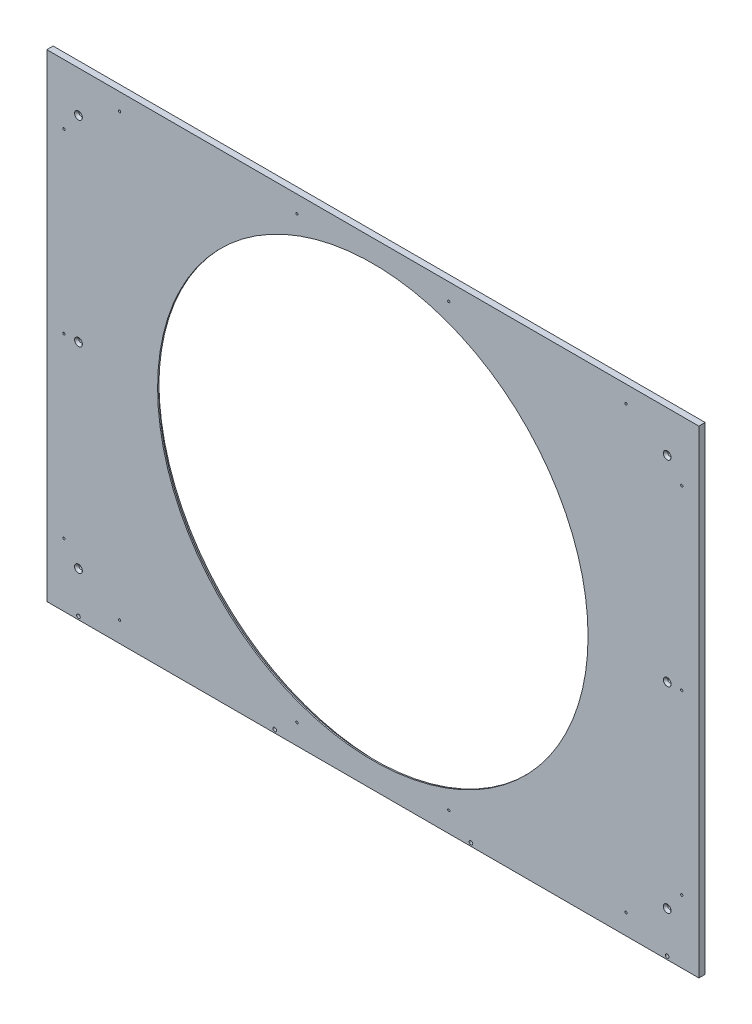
from build123d import *

# Parameters (mm, degrees)
SKETCH1_W                                         = 654.05
SKETCH1_H                                         = 479.425
SKETCH1_R                                         = 215.9
BOSS_EXTRUDE1_DEPTH                               = 6.35
CHAMFER1_SIZE                                     = 5.08
F_4_40_TAPPED_HOLE1_D                             = 2.2606
F_6_CLEARANCE_HOLE1_D                             = 3.6576
CSK_FOR_6_FLAT_HEAD_SOCKET_CAP_SCREW1_D           = 3.6576
CSK_FOR_6_FLAT_HEAD_SOCKET_CAP_SCREW1_CSINK_D     = 7.7978
CSK_FOR_6_FLAT_HEAD_SOCKET_CAP_SCREW1_CSINK_ANGLE = 82


with BuildPart() as part:
    # Sketch1 → Boss-Extrude1 (new body)
    with BuildSketch(Plane.XY):
        Rectangle(SKETCH1_W, SKETCH1_H)
        with Locations((0, 1.5875)):
            Circle(SKETCH1_R, mode=Mode.SUBTRACT)
    extrude(amount=BOSS_EXTRUDE1_DEPTH)

    # Chamfer1
    chamfer1_edges = [part.edges().sort_by_distance(p)[0] for p in [
        (-215.9, 1.5875, 0),
    ]]
    chamfer(chamfer1_edges, length=CHAMFER1_SIZE)

    # 4-40 Tapped Hole1 (through all)
    with Locations(Plane.XY.offset(6.35)):
        with Locations((-254, 222.5675), (-76.2, 222.5675), (76.2, 222.5675), (254, 222.5675), (254, -219.3925), (76.2, -219.3925), (-76.2, -219.3925), (-254, -219.3925), (-309.88, 179.3875), (-309.88, -176.2125), (309.88, -176.2125), (309.88, 1.5875), (309.88, 179.3875), (-309.88, 1.5875)):
            Hole(F_4_40_TAPPED_HOLE1_D / 2)

    # 6 Clearance Hole1 (through all)
    with Locations(Plane.XY.offset(6.35)):
        with Locations((-295.275, -236.5375), (-98.425, -236.5375), (98.425, -236.5375), (295.275, -236.5375)):
            Hole(F_6_CLEARANCE_HOLE1_D / 2)

    # CSK for _6 Flat Head Socket Cap Screw1 (through all)
    with Locations(Plane.XY.offset(6.35)):
        with Locations((-295.275, 198.4375), (-295.275, 1.5875), (-295.275, -195.2625), (295.275, -195.2625), (295.275, 1.5875), (295.275, 198.4375)):
            CounterSinkHole(CSK_FOR_6_FLAT_HEAD_SOCKET_CAP_SCREW1_D / 2, CSK_FOR_6_FLAT_HEAD_SOCKET_CAP_SCREW1_CSINK_D / 2, counter_sink_angle=CSK_FOR_6_FLAT_HEAD_SOCKET_CAP_SCREW1_CSINK_ANGLE)


solid = part.part
